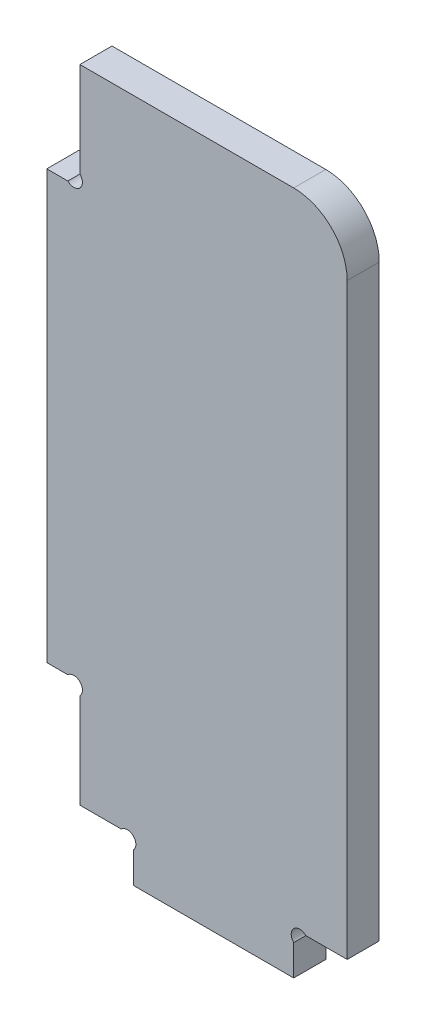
ISO-10303-21;
HEADER;
FILE_DESCRIPTION(('STEP AP214'),'2;1');
FILE_NAME('part.step','',(''),(''),'','','');
FILE_SCHEMA(('AUTOMOTIVE_DESIGN { 1 0 10303 214 1 1 1 1 }'));
ENDSEC;
DATA;
#1=APPLICATION_CONTEXT('core data for automotive mechanical design processes');
#2=APPLICATION_PROTOCOL_DEFINITION('international standard','automotive_design',2000,#1);
#3=PRODUCT_CONTEXT('',#1,'mechanical');
#4=PRODUCT('Part','Part','',(#3));
#5=PRODUCT_RELATED_PRODUCT_CATEGORY('part','',(#4));
#6=PRODUCT_DEFINITION_FORMATION('','',#4);
#7=PRODUCT_DEFINITION_CONTEXT('part definition',#1,'design');
#8=PRODUCT_DEFINITION('design','',#6,#7);
#9=PRODUCT_DEFINITION_SHAPE('','',#8);
#10=(LENGTH_UNIT() NAMED_UNIT(*) SI_UNIT(.MILLI.,.METRE.));
#11=(NAMED_UNIT(*) PLANE_ANGLE_UNIT() SI_UNIT($,.RADIAN.));
#12=(NAMED_UNIT(*) SI_UNIT($,.STERADIAN.) SOLID_ANGLE_UNIT());
#13=UNCERTAINTY_MEASURE_WITH_UNIT(LENGTH_MEASURE(1.E-05),#10,'distance_accuracy_value','');
#14=(GEOMETRIC_REPRESENTATION_CONTEXT(3) GLOBAL_UNCERTAINTY_ASSIGNED_CONTEXT((#13)) GLOBAL_UNIT_ASSIGNED_CONTEXT((#10,
#11,#12)) REPRESENTATION_CONTEXT('',''));
#15=CARTESIAN_POINT('',(0.,0.,0.));
#16=DIRECTION('',(0.,0.,1.));
#17=DIRECTION('',(1.,0.,0.));
#18=AXIS2_PLACEMENT_3D('',#15,#16,#17);
#19=CARTESIAN_POINT('',(46.2,120.,6.));
#20=DIRECTION('',(0.,0.,-1.));
#21=DIRECTION('',(-1.,0.,0.));
#22=AXIS2_PLACEMENT_3D('',#19,#20,#21);
#23=CYLINDRICAL_SURFACE('',#22,10.);
#24=CARTESIAN_POINT('',(46.2,120.,0.));
#25=DIRECTION('',(0.,0.,1.));
#26=DIRECTION('',(-1.,0.,0.));
#27=AXIS2_PLACEMENT_3D('',#24,#25,#26);
#28=CIRCLE('',#27,10.);
#29=CARTESIAN_POINT('',(56.2,120.,0.));
#30=VERTEX_POINT('',#29);
#31=CARTESIAN_POINT('',(46.1999999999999,130.,0.));
#32=VERTEX_POINT('',#31);
#33=EDGE_CURVE('E167',#30,#32,#28,.T.);
#34=ORIENTED_EDGE('',*,*,#33,.T.);
#35=DIRECTION('',(0.,0.,-1.));
#36=VECTOR('',#35,1.);
#37=CARTESIAN_POINT('',(46.1999999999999,130.,6.));
#38=LINE('',#37,#36);
#39=CARTESIAN_POINT('',(46.1999999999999,130.,6.));
#40=VERTEX_POINT('',#39);
#41=EDGE_CURVE('E11',#40,#32,#38,.T.);
#42=ORIENTED_EDGE('',*,*,#41,.F.);
#43=CARTESIAN_POINT('',(46.2,120.,6.));
#44=DIRECTION('',(0.,0.,1.));
#45=DIRECTION('',(-1.,0.,0.));
#46=AXIS2_PLACEMENT_3D('',#43,#44,#45);
#47=CIRCLE('',#46,10.);
#48=CARTESIAN_POINT('',(56.2,120.,6.));
#49=VERTEX_POINT('',#48);
#50=EDGE_CURVE('E199',#49,#40,#47,.T.);
#51=ORIENTED_EDGE('',*,*,#50,.F.);
#52=DIRECTION('',(0.,0.,-1.));
#53=VECTOR('',#52,1.);
#54=CARTESIAN_POINT('',(56.2,120.,6.));
#55=LINE('',#54,#53);
#56=EDGE_CURVE('E163',#49,#30,#55,.T.);
#57=ORIENTED_EDGE('',*,*,#56,.T.);
#58=EDGE_LOOP('',(#34,#42,#51,#57));
#59=FACE_BOUND('',#58,.T.);
#60=ADVANCED_FACE('F17',(#59),#23,.T.);
#61=CARTESIAN_POINT('',(6.2,130.,6.));
#62=DIRECTION('',(0.,-1.,0.));
#63=DIRECTION('',(0.,0.,-1.));
#64=AXIS2_PLACEMENT_3D('',#61,#62,#63);
#65=PLANE('',#64);
#66=DIRECTION('',(-1.,0.,0.));
#67=VECTOR('',#66,1.);
#68=CARTESIAN_POINT('',(6.2,130.,0.));
#69=LINE('',#68,#67);
#70=CARTESIAN_POINT('',(6.2,130.,0.));
#71=VERTEX_POINT('',#70);
#72=EDGE_CURVE('E170',#32,#71,#69,.T.);
#73=ORIENTED_EDGE('',*,*,#72,.T.);
#74=DIRECTION('',(0.,0.,-1.));
#75=VECTOR('',#74,1.);
#76=CARTESIAN_POINT('',(6.2,130.,6.));
#77=LINE('',#76,#75);
#78=CARTESIAN_POINT('',(6.2,130.,6.));
#79=VERTEX_POINT('',#78);
#80=EDGE_CURVE('E25',#79,#71,#77,.T.);
#81=ORIENTED_EDGE('',*,*,#80,.F.);
#82=DIRECTION('',(-1.,0.,0.));
#83=VECTOR('',#82,1.);
#84=CARTESIAN_POINT('',(6.2,130.,6.));
#85=LINE('',#84,#83);
#86=EDGE_CURVE('E103',#40,#79,#85,.T.);
#87=ORIENTED_EDGE('',*,*,#86,.F.);
#88=ORIENTED_EDGE('',*,*,#41,.T.);
#89=EDGE_LOOP('',(#73,#81,#87,#88));
#90=FACE_BOUND('',#89,.T.);
#91=ADVANCED_FACE('F304',(#90),#65,.F.);
#92=CARTESIAN_POINT('',(6.2,112.262741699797,6.));
#93=DIRECTION('',(1.,0.,0.));
#94=DIRECTION('',(0.,1.,0.));
#95=AXIS2_PLACEMENT_3D('',#92,#93,#94);
#96=PLANE('',#95);
#97=DIRECTION('',(0.,-1.,0.));
#98=VECTOR('',#97,1.);
#99=CARTESIAN_POINT('',(6.2,112.262741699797,0.));
#100=LINE('',#99,#98);
#101=CARTESIAN_POINT('',(6.2,112.262741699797,0.));
#102=VERTEX_POINT('',#101);
#103=EDGE_CURVE('E172',#71,#102,#100,.T.);
#104=ORIENTED_EDGE('',*,*,#103,.T.);
#105=DIRECTION('',(0.,0.,-1.));
#106=VECTOR('',#105,1.);
#107=CARTESIAN_POINT('',(6.2,112.262741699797,6.));
#108=LINE('',#107,#106);
#109=CARTESIAN_POINT('',(6.2,112.262741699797,6.));
#110=VERTEX_POINT('',#109);
#111=EDGE_CURVE('E233',#110,#102,#108,.T.);
#112=ORIENTED_EDGE('',*,*,#111,.F.);
#113=DIRECTION('',(0.,-1.,0.));
#114=VECTOR('',#113,1.);
#115=CARTESIAN_POINT('',(6.2,112.262741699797,6.));
#116=LINE('',#115,#114);
#117=EDGE_CURVE('E241',#79,#110,#116,.T.);
#118=ORIENTED_EDGE('',*,*,#117,.F.);
#119=ORIENTED_EDGE('',*,*,#80,.T.);
#120=EDGE_LOOP('',(#104,#112,#118,#119));
#121=FACE_BOUND('',#120,.T.);
#122=ADVANCED_FACE('F239',(#121),#96,.F.);
#123=CARTESIAN_POINT('',(5.06862915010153,111.131370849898,6.));
#124=DIRECTION('',(0.,0.,-1.));
#125=DIRECTION('',(-1.,0.,0.));
#126=AXIS2_PLACEMENT_3D('',#123,#124,#125);
#127=CYLINDRICAL_SURFACE('',#126,1.6);
#128=CARTESIAN_POINT('',(5.06862915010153,111.131370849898,0.));
#129=DIRECTION('',(0.,0.,-1.));
#130=DIRECTION('',(-1.,0.,0.));
#131=AXIS2_PLACEMENT_3D('',#128,#129,#130);
#132=CIRCLE('',#131,1.6);
#133=CARTESIAN_POINT('',(3.93725830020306,110.,0.));
#134=VERTEX_POINT('',#133);
#135=EDGE_CURVE('E174',#102,#134,#132,.T.);
#136=ORIENTED_EDGE('',*,*,#135,.T.);
#137=DIRECTION('',(0.,0.,-1.));
#138=VECTOR('',#137,1.);
#139=CARTESIAN_POINT('',(3.93725830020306,110.,6.));
#140=LINE('',#139,#138);
#141=CARTESIAN_POINT('',(3.93725830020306,110.,6.));
#142=VERTEX_POINT('',#141);
#143=EDGE_CURVE('E230',#142,#134,#140,.T.);
#144=ORIENTED_EDGE('',*,*,#143,.F.);
#145=CARTESIAN_POINT('',(5.06862915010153,111.131370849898,6.));
#146=DIRECTION('',(0.,0.,-1.));
#147=DIRECTION('',(-1.,0.,0.));
#148=AXIS2_PLACEMENT_3D('',#145,#146,#147);
#149=CIRCLE('',#148,1.6);
#150=EDGE_CURVE('E259',#110,#142,#149,.T.);
#151=ORIENTED_EDGE('',*,*,#150,.F.);
#152=ORIENTED_EDGE('',*,*,#111,.T.);
#153=EDGE_LOOP('',(#136,#144,#151,#152));
#154=FACE_BOUND('',#153,.T.);
#155=ADVANCED_FACE('F250',(#154),#127,.F.);
#156=CARTESIAN_POINT('',(3.93725830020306,110.,6.));
#157=DIRECTION('',(0.,-1.,0.));
#158=DIRECTION('',(0.,0.,-1.));
#159=AXIS2_PLACEMENT_3D('',#156,#157,#158);
#160=PLANE('',#159);
#161=DIRECTION('',(-1.,0.,0.));
#162=VECTOR('',#161,1.);
#163=CARTESIAN_POINT('',(3.93725830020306,110.,0.));
#164=LINE('',#163,#162);
#165=CARTESIAN_POINT('',(0.,110.,0.));
#166=VERTEX_POINT('',#165);
#167=EDGE_CURVE('E176',#134,#166,#164,.T.);
#168=ORIENTED_EDGE('',*,*,#167,.T.);
#169=DIRECTION('',(0.,0.,-1.));
#170=VECTOR('',#169,1.);
#171=CARTESIAN_POINT('',(0.,110.,6.));
#172=LINE('',#171,#170);
#173=CARTESIAN_POINT('',(0.,110.,6.));
#174=VERTEX_POINT('',#173);
#175=EDGE_CURVE('E227',#174,#166,#172,.T.);
#176=ORIENTED_EDGE('',*,*,#175,.F.);
#177=DIRECTION('',(-1.,0.,0.));
#178=VECTOR('',#177,1.);
#179=CARTESIAN_POINT('',(3.93725830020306,110.,6.));
#180=LINE('',#179,#178);
#181=EDGE_CURVE('E256',#142,#174,#180,.T.);
#182=ORIENTED_EDGE('',*,*,#181,.F.);
#183=ORIENTED_EDGE('',*,*,#143,.T.);
#184=EDGE_LOOP('',(#168,#176,#182,#183));
#185=FACE_BOUND('',#184,.T.);
#186=ADVANCED_FACE('F254',(#185),#160,.F.);
#187=CARTESIAN_POINT('',(0.,30.,6.));
#188=DIRECTION('',(1.,0.,0.));
#189=DIRECTION('',(0.,0.,-1.));
#190=AXIS2_PLACEMENT_3D('',#187,#188,#189);
#191=PLANE('',#190);
#192=DIRECTION('',(0.,-1.,0.));
#193=VECTOR('',#192,1.);
#194=CARTESIAN_POINT('',(0.,30.,0.));
#195=LINE('',#194,#193);
#196=CARTESIAN_POINT('',(0.,30.,0.));
#197=VERTEX_POINT('',#196);
#198=EDGE_CURVE('E178',#166,#197,#195,.T.);
#199=ORIENTED_EDGE('',*,*,#198,.T.);
#200=DIRECTION('',(0.,0.,-1.));
#201=VECTOR('',#200,1.);
#202=CARTESIAN_POINT('',(0.,30.,6.));
#203=LINE('',#202,#201);
#204=CARTESIAN_POINT('',(0.,30.,6.));
#205=VERTEX_POINT('',#204);
#206=EDGE_CURVE('E224',#205,#197,#203,.T.);
#207=ORIENTED_EDGE('',*,*,#206,.F.);
#208=DIRECTION('',(0.,-1.,0.));
#209=VECTOR('',#208,1.);
#210=CARTESIAN_POINT('',(0.,30.,6.));
#211=LINE('',#210,#209);
#212=EDGE_CURVE('E258',#174,#205,#211,.T.);
#213=ORIENTED_EDGE('',*,*,#212,.F.);
#214=ORIENTED_EDGE('',*,*,#175,.T.);
#215=EDGE_LOOP('',(#199,#207,#213,#214));
#216=FACE_BOUND('',#215,.T.);
#217=ADVANCED_FACE('F319',(#216),#191,.F.);
#218=CARTESIAN_POINT('',(3.93725830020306,30.,6.));
#219=DIRECTION('',(0.,1.,0.));
#220=DIRECTION('',(-1.,0.,0.));
#221=AXIS2_PLACEMENT_3D('',#218,#219,#220);
#222=PLANE('',#221);
#223=DIRECTION('',(1.,0.,0.));
#224=VECTOR('',#223,1.);
#225=CARTESIAN_POINT('',(3.93725830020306,30.,0.));
#226=LINE('',#225,#224);
#227=CARTESIAN_POINT('',(3.93725830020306,30.,0.));
#228=VERTEX_POINT('',#227);
#229=EDGE_CURVE('E180',#197,#228,#226,.T.);
#230=ORIENTED_EDGE('',*,*,#229,.T.);
#231=DIRECTION('',(0.,0.,-1.));
#232=VECTOR('',#231,1.);
#233=CARTESIAN_POINT('',(3.93725830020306,30.,6.));
#234=LINE('',#233,#232);
#235=CARTESIAN_POINT('',(3.93725830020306,30.,6.));
#236=VERTEX_POINT('',#235);
#237=EDGE_CURVE('E221',#236,#228,#234,.T.);
#238=ORIENTED_EDGE('',*,*,#237,.F.);
#239=DIRECTION('',(1.,0.,0.));
#240=VECTOR('',#239,1.);
#241=CARTESIAN_POINT('',(3.93725830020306,30.,6.));
#242=LINE('',#241,#240);
#243=EDGE_CURVE('E261',#205,#236,#242,.T.);
#244=ORIENTED_EDGE('',*,*,#243,.F.);
#245=ORIENTED_EDGE('',*,*,#206,.T.);
#246=EDGE_LOOP('',(#230,#238,#244,#245));
#247=FACE_BOUND('',#246,.T.);
#248=ADVANCED_FACE('F322',(#247),#222,.F.);
#249=CARTESIAN_POINT('',(5.06862915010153,28.8686291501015,6.));
#250=DIRECTION('',(0.,0.,-1.));
#251=DIRECTION('',(-1.,0.,0.));
#252=AXIS2_PLACEMENT_3D('',#249,#250,#251);
#253=CYLINDRICAL_SURFACE('',#252,1.6);
#254=CARTESIAN_POINT('',(5.06862915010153,28.8686291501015,0.));
#255=DIRECTION('',(0.,0.,-1.));
#256=DIRECTION('',(1.,0.,0.));
#257=AXIS2_PLACEMENT_3D('',#254,#255,#256);
#258=CIRCLE('',#257,1.6);
#259=CARTESIAN_POINT('',(6.2,27.737258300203,0.));
#260=VERTEX_POINT('',#259);
#261=EDGE_CURVE('E182',#228,#260,#258,.T.);
#262=ORIENTED_EDGE('',*,*,#261,.T.);
#263=DIRECTION('',(0.,0.,-1.));
#264=VECTOR('',#263,1.);
#265=CARTESIAN_POINT('',(6.2,27.737258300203,6.));
#266=LINE('',#265,#264);
#267=CARTESIAN_POINT('',(6.2,27.737258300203,6.));
#268=VERTEX_POINT('',#267);
#269=EDGE_CURVE('E218',#268,#260,#266,.T.);
#270=ORIENTED_EDGE('',*,*,#269,.F.);
#271=CARTESIAN_POINT('',(5.06862915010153,28.8686291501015,6.));
#272=DIRECTION('',(0.,0.,-1.));
#273=DIRECTION('',(1.,0.,0.));
#274=AXIS2_PLACEMENT_3D('',#271,#272,#273);
#275=CIRCLE('',#274,1.6);
#276=EDGE_CURVE('E267',#236,#268,#275,.T.);
#277=ORIENTED_EDGE('',*,*,#276,.F.);
#278=ORIENTED_EDGE('',*,*,#237,.T.);
#279=EDGE_LOOP('',(#262,#270,#277,#278));
#280=FACE_BOUND('',#279,.T.);
#281=ADVANCED_FACE('F326',(#280),#253,.F.);
#282=CARTESIAN_POINT('',(6.2,27.737258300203,6.));
#283=DIRECTION('',(1.,0.,0.));
#284=DIRECTION('',(0.,1.,0.));
#285=AXIS2_PLACEMENT_3D('',#282,#283,#284);
#286=PLANE('',#285);
#287=DIRECTION('',(0.,-1.,0.));
#288=VECTOR('',#287,1.);
#289=CARTESIAN_POINT('',(6.2,27.737258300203,0.));
#290=LINE('',#289,#288);
#291=CARTESIAN_POINT('',(6.2000000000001,10.,0.));
#292=VERTEX_POINT('',#291);
#293=EDGE_CURVE('E184',#260,#292,#290,.T.);
#294=ORIENTED_EDGE('',*,*,#293,.T.);
#295=DIRECTION('',(0.,0.,-1.));
#296=VECTOR('',#295,1.);
#297=CARTESIAN_POINT('',(6.2000000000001,10.,6.));
#298=LINE('',#297,#296);
#299=CARTESIAN_POINT('',(6.2000000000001,10.,6.));
#300=VERTEX_POINT('',#299);
#301=EDGE_CURVE('E215',#300,#292,#298,.T.);
#302=ORIENTED_EDGE('',*,*,#301,.F.);
#303=DIRECTION('',(0.,-1.,0.));
#304=VECTOR('',#303,1.);
#305=CARTESIAN_POINT('',(6.2,27.737258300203,6.));
#306=LINE('',#305,#304);
#307=EDGE_CURVE('E269',#268,#300,#306,.T.);
#308=ORIENTED_EDGE('',*,*,#307,.F.);
#309=ORIENTED_EDGE('',*,*,#269,.T.);
#310=EDGE_LOOP('',(#294,#302,#308,#309));
#311=FACE_BOUND('',#310,.T.);
#312=ADVANCED_FACE('F330',(#311),#286,.F.);
#313=CARTESIAN_POINT('',(13.9372583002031,10.,6.));
#314=DIRECTION('',(0.,1.,0.));
#315=DIRECTION('',(-1.,0.,0.));
#316=AXIS2_PLACEMENT_3D('',#313,#314,#315);
#317=PLANE('',#316);
#318=DIRECTION('',(1.,0.,0.));
#319=VECTOR('',#318,1.);
#320=CARTESIAN_POINT('',(13.9372583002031,10.,0.));
#321=LINE('',#320,#319);
#322=CARTESIAN_POINT('',(13.9372583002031,10.,0.));
#323=VERTEX_POINT('',#322);
#324=EDGE_CURVE('E186',#292,#323,#321,.T.);
#325=ORIENTED_EDGE('',*,*,#324,.T.);
#326=DIRECTION('',(0.,0.,-1.));
#327=VECTOR('',#326,1.);
#328=CARTESIAN_POINT('',(13.9372583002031,10.,6.));
#329=LINE('',#328,#327);
#330=CARTESIAN_POINT('',(13.9372583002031,10.,6.));
#331=VERTEX_POINT('',#330);
#332=EDGE_CURVE('E212',#331,#323,#329,.T.);
#333=ORIENTED_EDGE('',*,*,#332,.F.);
#334=DIRECTION('',(1.,0.,0.));
#335=VECTOR('',#334,1.);
#336=CARTESIAN_POINT('',(13.9372583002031,10.,6.));
#337=LINE('',#336,#335);
#338=EDGE_CURVE('E271',#300,#331,#337,.T.);
#339=ORIENTED_EDGE('',*,*,#338,.F.);
#340=ORIENTED_EDGE('',*,*,#301,.T.);
#341=EDGE_LOOP('',(#325,#333,#339,#340));
#342=FACE_BOUND('',#341,.T.);
#343=ADVANCED_FACE('F334',(#342),#317,.F.);
#344=CARTESIAN_POINT('',(15.0686291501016,8.86862915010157,6.));
#345=DIRECTION('',(0.,0.,-1.));
#346=DIRECTION('',(-1.,0.,0.));
#347=AXIS2_PLACEMENT_3D('',#344,#345,#346);
#348=CYLINDRICAL_SURFACE('',#347,1.59999999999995);
#349=CARTESIAN_POINT('',(15.0686291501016,8.86862915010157,0.));
#350=DIRECTION('',(0.,0.,-1.));
#351=DIRECTION('',(1.,0.,0.));
#352=AXIS2_PLACEMENT_3D('',#349,#350,#351);
#353=CIRCLE('',#352,1.59999999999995);
#354=CARTESIAN_POINT('',(16.2,7.73725830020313,0.));
#355=VERTEX_POINT('',#354);
#356=EDGE_CURVE('E188',#323,#355,#353,.T.);
#357=ORIENTED_EDGE('',*,*,#356,.T.);
#358=DIRECTION('',(0.,0.,-1.));
#359=VECTOR('',#358,1.);
#360=CARTESIAN_POINT('',(16.2,7.73725830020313,6.));
#361=LINE('',#360,#359);
#362=CARTESIAN_POINT('',(16.2,7.73725830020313,6.));
#363=VERTEX_POINT('',#362);
#364=EDGE_CURVE('E209',#363,#355,#361,.T.);
#365=ORIENTED_EDGE('',*,*,#364,.F.);
#366=CARTESIAN_POINT('',(15.0686291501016,8.86862915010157,6.));
#367=DIRECTION('',(0.,0.,-1.));
#368=DIRECTION('',(1.,0.,0.));
#369=AXIS2_PLACEMENT_3D('',#366,#367,#368);
#370=CIRCLE('',#369,1.59999999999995);
#371=EDGE_CURVE('E273',#331,#363,#370,.T.);
#372=ORIENTED_EDGE('',*,*,#371,.F.);
#373=ORIENTED_EDGE('',*,*,#332,.T.);
#374=EDGE_LOOP('',(#357,#365,#372,#373));
#375=FACE_BOUND('',#374,.T.);
#376=ADVANCED_FACE('F338',(#375),#348,.F.);
#377=CARTESIAN_POINT('',(16.2,7.73725830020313,6.));
#378=DIRECTION('',(1.,0.,0.));
#379=DIRECTION('',(0.,1.,0.));
#380=AXIS2_PLACEMENT_3D('',#377,#378,#379);
#381=PLANE('',#380);
#382=DIRECTION('',(0.,-1.,0.));
#383=VECTOR('',#382,1.);
#384=CARTESIAN_POINT('',(16.2,7.73725830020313,0.));
#385=LINE('',#384,#383);
#386=CARTESIAN_POINT('',(16.2,1.99999999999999,0.));
#387=VERTEX_POINT('',#386);
#388=EDGE_CURVE('E190',#355,#387,#385,.T.);
#389=ORIENTED_EDGE('',*,*,#388,.T.);
#390=DIRECTION('',(0.,0.,-1.));
#391=VECTOR('',#390,1.);
#392=CARTESIAN_POINT('',(16.2,1.99999999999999,6.));
#393=LINE('',#392,#391);
#394=CARTESIAN_POINT('',(16.2,1.99999999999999,6.));
#395=VERTEX_POINT('',#394);
#396=EDGE_CURVE('E206',#395,#387,#393,.T.);
#397=ORIENTED_EDGE('',*,*,#396,.F.);
#398=DIRECTION('',(0.,-1.,0.));
#399=VECTOR('',#398,1.);
#400=CARTESIAN_POINT('',(16.2,7.73725830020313,6.));
#401=LINE('',#400,#399);
#402=EDGE_CURVE('E275',#363,#395,#401,.T.);
#403=ORIENTED_EDGE('',*,*,#402,.F.);
#404=ORIENTED_EDGE('',*,*,#364,.T.);
#405=EDGE_LOOP('',(#389,#397,#403,#404));
#406=FACE_BOUND('',#405,.T.);
#407=ADVANCED_FACE('F342',(#406),#381,.F.);
#408=CARTESIAN_POINT('',(16.2,1.99999999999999,6.));
#409=DIRECTION('',(0.,1.,0.));
#410=DIRECTION('',(-1.,0.,0.));
#411=AXIS2_PLACEMENT_3D('',#408,#409,#410);
#412=PLANE('',#411);
#413=DIRECTION('',(1.,0.,0.));
#414=VECTOR('',#413,1.);
#415=CARTESIAN_POINT('',(16.2,1.99999999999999,0.));
#416=LINE('',#415,#414);
#417=CARTESIAN_POINT('',(46.2,2.,0.));
#418=VERTEX_POINT('',#417);
#419=EDGE_CURVE('E192',#387,#418,#416,.T.);
#420=ORIENTED_EDGE('',*,*,#419,.T.);
#421=DIRECTION('',(0.,0.,-1.));
#422=VECTOR('',#421,1.);
#423=CARTESIAN_POINT('',(46.2,2.,6.));
#424=LINE('',#423,#422);
#425=CARTESIAN_POINT('',(46.2,2.,6.));
#426=VERTEX_POINT('',#425);
#427=EDGE_CURVE('E203',#426,#418,#424,.T.);
#428=ORIENTED_EDGE('',*,*,#427,.F.);
#429=DIRECTION('',(1.,0.,0.));
#430=VECTOR('',#429,1.);
#431=CARTESIAN_POINT('',(16.2,1.99999999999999,6.));
#432=LINE('',#431,#430);
#433=EDGE_CURVE('E277',#395,#426,#432,.T.);
#434=ORIENTED_EDGE('',*,*,#433,.F.);
#435=ORIENTED_EDGE('',*,*,#396,.T.);
#436=EDGE_LOOP('',(#420,#428,#434,#435));
#437=FACE_BOUND('',#436,.T.);
#438=ADVANCED_FACE('F283',(#437),#412,.F.);
#439=CARTESIAN_POINT('',(46.2,7.73725830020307,6.));
#440=DIRECTION('',(-1.,0.,0.));
#441=DIRECTION('',(0.,-1.,0.));
#442=AXIS2_PLACEMENT_3D('',#439,#440,#441);
#443=PLANE('',#442);
#444=DIRECTION('',(0.,1.,0.));
#445=VECTOR('',#444,1.);
#446=CARTESIAN_POINT('',(46.2,7.73725830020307,0.));
#447=LINE('',#446,#445);
#448=CARTESIAN_POINT('',(46.2,7.73725830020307,0.));
#449=VERTEX_POINT('',#448);
#450=EDGE_CURVE('E194',#418,#449,#447,.T.);
#451=ORIENTED_EDGE('',*,*,#450,.T.);
#452=DIRECTION('',(0.,0.,-1.));
#453=VECTOR('',#452,1.);
#454=CARTESIAN_POINT('',(46.2,7.73725830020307,6.));
#455=LINE('',#454,#453);
#456=CARTESIAN_POINT('',(46.2,7.73725830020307,6.));
#457=VERTEX_POINT('',#456);
#458=EDGE_CURVE('E158',#457,#449,#455,.T.);
#459=ORIENTED_EDGE('',*,*,#458,.F.);
#460=DIRECTION('',(0.,1.,0.));
#461=VECTOR('',#460,1.);
#462=CARTESIAN_POINT('',(46.2,7.73725830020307,6.));
#463=LINE('',#462,#461);
#464=EDGE_CURVE('E149',#426,#457,#463,.T.);
#465=ORIENTED_EDGE('',*,*,#464,.F.);
#466=ORIENTED_EDGE('',*,*,#427,.T.);
#467=EDGE_LOOP('',(#451,#459,#465,#466));
#468=FACE_BOUND('',#467,.T.);
#469=ADVANCED_FACE('F287',(#468),#443,.F.);
#470=CARTESIAN_POINT('',(47.3313708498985,8.86862915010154,6.));
#471=DIRECTION('',(0.,0.,-1.));
#472=DIRECTION('',(-1.,0.,0.));
#473=AXIS2_PLACEMENT_3D('',#470,#471,#472);
#474=CYLINDRICAL_SURFACE('',#473,1.59999999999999);
#475=CARTESIAN_POINT('',(47.3313708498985,8.86862915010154,0.));
#476=DIRECTION('',(0.,0.,-1.));
#477=DIRECTION('',(-1.,0.,0.));
#478=AXIS2_PLACEMENT_3D('',#475,#476,#477);
#479=CIRCLE('',#478,1.59999999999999);
#480=CARTESIAN_POINT('',(48.462741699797,10.,0.));
#481=VERTEX_POINT('',#480);
#482=EDGE_CURVE('E157',#449,#481,#479,.T.);
#483=ORIENTED_EDGE('',*,*,#482,.T.);
#484=DIRECTION('',(0.,0.,-1.));
#485=VECTOR('',#484,1.);
#486=CARTESIAN_POINT('',(48.462741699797,10.,6.));
#487=LINE('',#486,#485);
#488=CARTESIAN_POINT('',(48.462741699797,10.,6.));
#489=VERTEX_POINT('',#488);
#490=EDGE_CURVE('E154',#489,#481,#487,.T.);
#491=ORIENTED_EDGE('',*,*,#490,.F.);
#492=CARTESIAN_POINT('',(47.3313708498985,8.86862915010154,6.));
#493=DIRECTION('',(0.,0.,-1.));
#494=DIRECTION('',(-1.,0.,0.));
#495=AXIS2_PLACEMENT_3D('',#492,#493,#494);
#496=CIRCLE('',#495,1.59999999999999);
#497=EDGE_CURVE('E143',#457,#489,#496,.T.);
#498=ORIENTED_EDGE('',*,*,#497,.F.);
#499=ORIENTED_EDGE('',*,*,#458,.T.);
#500=EDGE_LOOP('',(#483,#491,#498,#499));
#501=FACE_BOUND('',#500,.T.);
#502=ADVANCED_FACE('F155',(#501),#474,.F.);
#503=CARTESIAN_POINT('',(48.462741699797,10.,6.));
#504=DIRECTION('',(0.,1.,0.));
#505=DIRECTION('',(-1.,0.,0.));
#506=AXIS2_PLACEMENT_3D('',#503,#504,#505);
#507=PLANE('',#506);
#508=DIRECTION('',(1.,0.,0.));
#509=VECTOR('',#508,1.);
#510=CARTESIAN_POINT('',(48.462741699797,10.,0.));
#511=LINE('',#510,#509);
#512=CARTESIAN_POINT('',(56.2,10.,0.));
#513=VERTEX_POINT('',#512);
#514=EDGE_CURVE('E89',#481,#513,#511,.T.);
#515=ORIENTED_EDGE('',*,*,#514,.T.);
#516=DIRECTION('',(0.,0.,-1.));
#517=VECTOR('',#516,1.);
#518=CARTESIAN_POINT('',(56.2,10.,6.));
#519=LINE('',#518,#517);
#520=CARTESIAN_POINT('',(56.2,10.,6.));
#521=VERTEX_POINT('',#520);
#522=EDGE_CURVE('E159',#521,#513,#519,.T.);
#523=ORIENTED_EDGE('',*,*,#522,.F.);
#524=DIRECTION('',(1.,0.,0.));
#525=VECTOR('',#524,1.);
#526=CARTESIAN_POINT('',(48.462741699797,10.,6.));
#527=LINE('',#526,#525);
#528=EDGE_CURVE('E147',#489,#521,#527,.T.);
#529=ORIENTED_EDGE('',*,*,#528,.F.);
#530=ORIENTED_EDGE('',*,*,#490,.T.);
#531=EDGE_LOOP('',(#515,#523,#529,#530));
#532=FACE_BOUND('',#531,.T.);
#533=ADVANCED_FACE('F161',(#532),#507,.F.);
#534=CARTESIAN_POINT('',(56.2,120.,6.));
#535=DIRECTION('',(-1.,0.,0.));
#536=DIRECTION('',(0.,0.,1.));
#537=AXIS2_PLACEMENT_3D('',#534,#535,#536);
#538=PLANE('',#537);
#539=DIRECTION('',(0.,1.,0.));
#540=VECTOR('',#539,1.);
#541=CARTESIAN_POINT('',(56.2,120.,0.));
#542=LINE('',#541,#540);
#543=EDGE_CURVE('E95',#513,#30,#542,.T.);
#544=ORIENTED_EDGE('',*,*,#543,.T.);
#545=ORIENTED_EDGE('',*,*,#56,.F.);
#546=DIRECTION('',(0.,1.,0.));
#547=VECTOR('',#546,1.);
#548=CARTESIAN_POINT('',(56.2,120.,6.));
#549=LINE('',#548,#547);
#550=EDGE_CURVE('E33',#521,#49,#549,.T.);
#551=ORIENTED_EDGE('',*,*,#550,.F.);
#552=ORIENTED_EDGE('',*,*,#522,.T.);
#553=EDGE_LOOP('',(#544,#545,#551,#552));
#554=FACE_BOUND('',#553,.T.);
#555=ADVANCED_FACE('F291',(#554),#538,.F.);
#556=CARTESIAN_POINT('',(46.2,120.,6.));
#557=DIRECTION('',(0.,0.,-1.));
#558=DIRECTION('',(-1.,0.,0.));
#559=AXIS2_PLACEMENT_3D('',#556,#557,#558);
#560=PLANE('',#559);
#561=ORIENTED_EDGE('',*,*,#50,.T.);
#562=ORIENTED_EDGE('',*,*,#86,.T.);
#563=ORIENTED_EDGE('',*,*,#117,.T.);
#564=ORIENTED_EDGE('',*,*,#150,.T.);
#565=ORIENTED_EDGE('',*,*,#181,.T.);
#566=ORIENTED_EDGE('',*,*,#212,.T.);
#567=ORIENTED_EDGE('',*,*,#243,.T.);
#568=ORIENTED_EDGE('',*,*,#276,.T.);
#569=ORIENTED_EDGE('',*,*,#307,.T.);
#570=ORIENTED_EDGE('',*,*,#338,.T.);
#571=ORIENTED_EDGE('',*,*,#371,.T.);
#572=ORIENTED_EDGE('',*,*,#402,.T.);
#573=ORIENTED_EDGE('',*,*,#433,.T.);
#574=ORIENTED_EDGE('',*,*,#464,.T.);
#575=ORIENTED_EDGE('',*,*,#497,.T.);
#576=ORIENTED_EDGE('',*,*,#528,.T.);
#577=ORIENTED_EDGE('',*,*,#550,.T.);
#578=EDGE_LOOP('',(#561,#562,#563,#564,#565,#566,#567,#568,#569,#570,#571,#572,#573,#574,#575,
#576,#577));
#579=FACE_BOUND('',#578,.T.);
#580=ADVANCED_FACE('F145',(#579),#560,.F.);
#581=CARTESIAN_POINT('',(46.2,120.,0.));
#582=DIRECTION('',(0.,0.,-1.));
#583=DIRECTION('',(-1.,0.,0.));
#584=AXIS2_PLACEMENT_3D('',#581,#582,#583);
#585=PLANE('',#584);
#586=ORIENTED_EDGE('',*,*,#33,.F.);
#587=ORIENTED_EDGE('',*,*,#543,.F.);
#588=ORIENTED_EDGE('',*,*,#514,.F.);
#589=ORIENTED_EDGE('',*,*,#482,.F.);
#590=ORIENTED_EDGE('',*,*,#450,.F.);
#591=ORIENTED_EDGE('',*,*,#419,.F.);
#592=ORIENTED_EDGE('',*,*,#388,.F.);
#593=ORIENTED_EDGE('',*,*,#356,.F.);
#594=ORIENTED_EDGE('',*,*,#324,.F.);
#595=ORIENTED_EDGE('',*,*,#293,.F.);
#596=ORIENTED_EDGE('',*,*,#261,.F.);
#597=ORIENTED_EDGE('',*,*,#229,.F.);
#598=ORIENTED_EDGE('',*,*,#198,.F.);
#599=ORIENTED_EDGE('',*,*,#167,.F.);
#600=ORIENTED_EDGE('',*,*,#135,.F.);
#601=ORIENTED_EDGE('',*,*,#103,.F.);
#602=ORIENTED_EDGE('',*,*,#72,.F.);
#603=EDGE_LOOP('',(#586,#587,#588,#589,#590,#591,#592,#593,#594,#595,#596,#597,#598,#599,#600,
#601,#602));
#604=FACE_BOUND('',#603,.T.);
#605=ADVANCED_FACE('F245',(#604),#585,.T.);
#606=CLOSED_SHELL('',(#60,#91,#122,#155,#186,#217,#248,#281,#312,#343,#376,#407,#438,#469,#502,
#533,#555,#580,#605));
#607=MANIFOLD_SOLID_BREP('B1',#606);
#608=ADVANCED_BREP_SHAPE_REPRESENTATION('',(#18,#607),#14);
#609=SHAPE_DEFINITION_REPRESENTATION(#9,#608);
ENDSEC;
END-ISO-10303-21;
